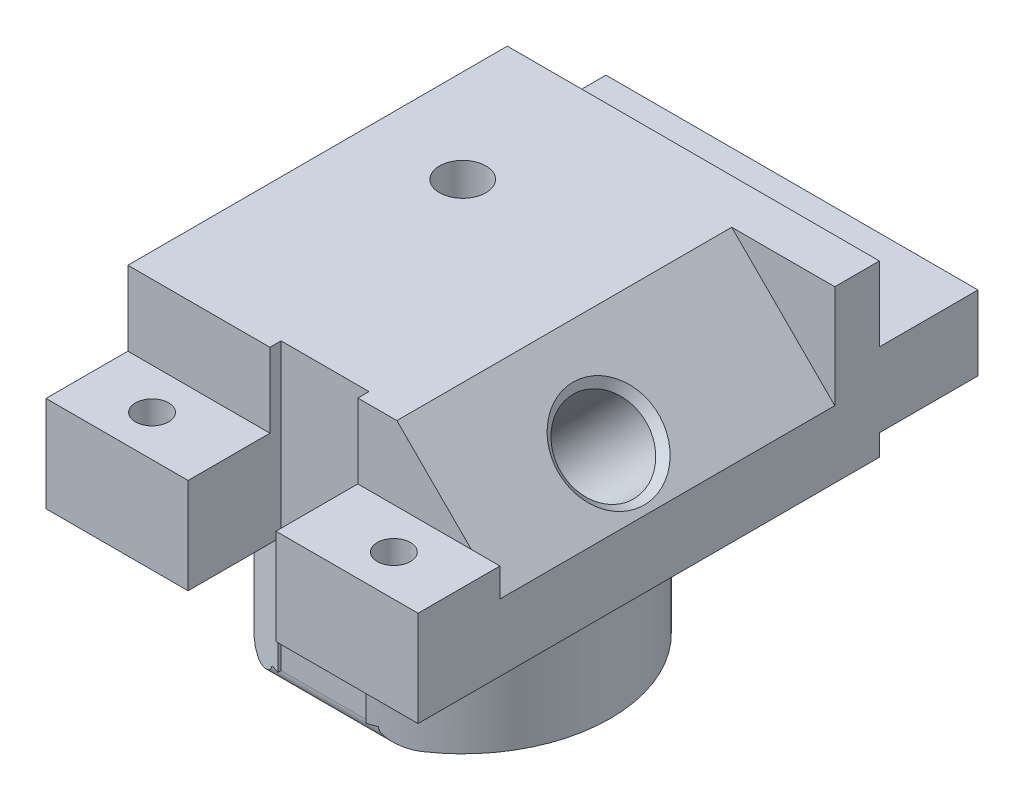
from build123d import *

# Parameters (mm, degrees)
SKETCH1_W                           = 36.83
SKETCH1_H                           = 34.163
BOSS_EXTRUDE1_DEPTH                 = 12.7
SKETCH2_R                           = 10.075653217
BOSS_EXTRUDE2_DEPTH                 = 8.89
SKETCH9_R                           = 1.640477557
BOSS_EXTRUDE3_DEPTH                 = 4.7244
BOSS_EXTRUDE3_TAPER                 = 4
SKETCH5_W                           = 36.83
SKETCH5_H                           = 2.667
CUT_EXTRUDE1_DEPTH                  = 6.175
SKETCH6_W                           = 36.83
SKETCH6_H                           = 5.588
CUT_EXTRUDE2_DEPTH                  = 6.175
F_4_40_TAPPED_HOLE2_D               = 2.2606
CHAMFER2_SIZE                       = 5.08
CUT_EXTRUDE3_DEPTH                  = 22.86
SKETCH14_R                          = 2.921
CUT_EXTRUDE5_DEPTH                  = 8.89
CHAMFER1_SIZE                       = 0.508
F_5_64_0_07813_DIAMETER_HOLE2_D     = 1.984502
F_5_64_0_07813_DIAMETER_HOLE2_DEPTH = 5.08
F_5_64_0_07813_DIAMETER_HOLE2_TIP   = 0.59620455
F_5_64_0_07813_DIAMETER_HOLE1_D     = 1.984502
F_5_64_0_07813_DIAMETER_HOLE1_DEPTH = 11.557
F_5_64_0_07813_DIAMETER_HOLE1_TIP   = 0.59620455
SKETCH21_W                          = 36.83
SKETCH21_H                          = 5.08
BOSS_EXTRUDE4_DEPTH                 = 4.064
F_4_CLEARANCE_HOLE1_D               = 2.9464
CUT_EXTRUDE6_REACH                  = 56.801
SKETCH25_W                          = 25.908
SKETCH25_H                          = 1.095
CUT_EXTRUDE7_REACH                  = 56.801
SKETCH26_W                          = 5.715
SKETCH26_H                          = 11.605
SKETCH27_W                          = 25.4
SKETCH27_H                          = 1.445
CUT_EXTRUDE8_DEPTH                  = 2.667
FILLET1_R                           = 0.127
F_1_8_0_125_DIAMETER_HOLE1_D        = 3.175
F_1_8_0_125_DIAMETER_HOLE1_DEPTH    = 10.16
SKETCH31_W                          = 6
SKETCH31_H                          = 20.495
CUT_EXTRUDE9_DEPTH                  = 6.35
CUT_EXTRUDE10_DEPTH                 = 6.35
CUT_EXTRUDE10_DEPTH_BACK            = 6.35


with BuildPart() as part:
    # Sketch1 → Boss-Extrude1 (new body)
    with BuildSketch(Plane(origin=(0, 0, 0), x_dir=(1, 0, 0), z_dir=(0, 1, 0))):
        with Locations((18.415, 17.0815)):
            Rectangle(SKETCH1_W, SKETCH1_H)
    extrude(amount=BOSS_EXTRUDE1_DEPTH)

    # Sketch2 → Boss-Extrude2 (add)
    with BuildSketch(Plane.XZ):
        with Locations(Location((18.415, -15.748, 0), (0, 0, 270))):
            Circle(SKETCH2_R)
    extrude(amount=BOSS_EXTRUDE2_DEPTH)

    # Sketch9 → Boss-Extrude3 (add)
    with BuildSketch(Plane.XZ.offset(8.89)):
        with Locations((18.415, -15.748)):
            Circle(SKETCH9_R)
    extrude(amount=BOSS_EXTRUDE3_DEPTH, taper=BOSS_EXTRUDE3_TAPER)

    # Sketch5 → Cut-Extrude1 (cut)
    with BuildSketch(Plane(origin=(0, 12.7, 0), x_dir=(1, 0, 0), z_dir=(0, 1, 0))):
        with Locations((18.415, 32.8295)):
            Rectangle(SKETCH5_W, SKETCH5_H)
    extrude(amount=-CUT_EXTRUDE1_DEPTH, mode=Mode.SUBTRACT)

    # Sketch6 → Cut-Extrude2 (cut)
    with BuildSketch(Plane(origin=(0, 12.7, 0), x_dir=(1, 0, 0), z_dir=(0, 1, 0))):
        with Locations((18.415, 2.794)):
            Rectangle(SKETCH6_W, SKETCH6_H)
    extrude(amount=-CUT_EXTRUDE2_DEPTH, mode=Mode.SUBTRACT)

    # 4-40 Tapped Hole2 (through all)
    with Locations(Plane(origin=(0, 6.525, 0), x_dir=(1, 0, 0), z_dir=(0, 1, 0))):
        with Locations((10.16, 2.794), (26.67, 2.794)):
            Hole(F_4_40_TAPPED_HOLE2_D / 2)

    # Chamfer2
    chamfer2_edges = [part.edges().sort_by_distance(p)[0] for p in [
        (36.83, 3.2625, 0),
        (0, 3.2625, 0),
    ]]
    chamfer(chamfer2_edges, length=CHAMFER2_SIZE)

    # Sketch10 → Cut-Extrude3 (cut)
    with BuildSketch(Plane(origin=(0, 0, -28.448), x_dir=(-1, 0, 0), z_dir=(0, 0, -1))):
        Polygon((-36.83, 12.7), (-22.987, 12.7), (-36.83, -1.143), align=None)
    extrude(amount=-CUT_EXTRUDE3_DEPTH, mode=Mode.SUBTRACT)

    # Sketch14 → Cut-Extrude5 (cut)
    with BuildSketch(Plane(origin=(26.480752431, 9.206247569, -1.2015923), x_dir=(0, 0, -1), z_dir=(0.7071067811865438, 0.7071067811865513, 0))):
        with Locations(Location((14.5464077, -2.679087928, 0), (0, 0, 90))):
            Circle(SKETCH14_R)
    extrude(amount=-CUT_EXTRUDE5_DEPTH, mode=Mode.SUBTRACT)

    # Chamfer1
    chamfer1_edges = [part.edges().sort_by_distance(p)[0] for p in [
        (30.44061258, 5.24638742, -15.748),
    ]]
    chamfer(chamfer1_edges, length=CHAMFER1_SIZE)

    # 5_64 _0.07813_ Diameter Hole2
    with Locations(Plane(origin=(11.557320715, 11.557320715, 0), x_dir=(0, 0, -1), z_dir=(0.7071067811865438, 0.7071067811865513, 0))):
        with Locations((15.748, -14.894007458)):
            Hole(F_5_64_0_07813_DIAMETER_HOLE2_D / 2, depth=F_5_64_0_07813_DIAMETER_HOLE2_DEPTH)
            with Locations((0, 0, -(F_5_64_0_07813_DIAMETER_HOLE2_DEPTH + F_5_64_0_07813_DIAMETER_HOLE2_TIP / 2))):  # 118° drill point
                Cone(0, F_5_64_0_07813_DIAMETER_HOLE2_D / 2, F_5_64_0_07813_DIAMETER_HOLE2_TIP, mode=Mode.SUBTRACT)

    # 5_64 _0.07813_ Diameter Hole1
    with Locations(Plane(origin=(0, -13.6144, 0), x_dir=(-1, 0, 0), z_dir=(0, -1, 0))):
        with Locations((-18.415, 15.748)):
            Hole(F_5_64_0_07813_DIAMETER_HOLE1_D / 2, depth=F_5_64_0_07813_DIAMETER_HOLE1_DEPTH)
            with Locations((0, 0, -(F_5_64_0_07813_DIAMETER_HOLE1_DEPTH + F_5_64_0_07813_DIAMETER_HOLE1_TIP / 2))):  # 118° drill point
                Cone(0, F_5_64_0_07813_DIAMETER_HOLE1_D / 2, F_5_64_0_07813_DIAMETER_HOLE1_TIP, mode=Mode.SUBTRACT)

    # Sketch21 → Boss-Extrude4 (add)
    with BuildSketch(Plane(origin=(0, 0, -34.163), x_dir=(-1, 0, 0), z_dir=(0, 0, -1))):
        with Locations((-18.415, 3.985)):
            Rectangle(SKETCH21_W, SKETCH21_H)
    extrude(amount=BOSS_EXTRUDE4_DEPTH)

    # 4 Clearance Hole1 (through all)
    with Locations(Plane(origin=(0, 0, 0), x_dir=(-1, 0, 0), z_dir=(0, -1, 0))):
        with Locations((-25.4, 34.8615), (-11.43, 34.8615)):
            Hole(F_4_CLEARANCE_HOLE1_D / 2)

    # Sketch25 → Cut-Extrude6 (cut, up to next)
    with BuildSketch(Plane.ZY, mode=Mode.PRIVATE) as cut_extrude6_sk1:
        with Locations((-18.542, 12.1525)):
            Rectangle(SKETCH25_W, SKETCH25_H)
    cut_extrude6_tool1 = extrude(cut_extrude6_sk1.sketch, amount=-CUT_EXTRUDE6_REACH, mode=Mode.PRIVATE) & part.part
    add(cut_extrude6_tool1.solids().sort_by_distance((0, 12.1525, -18.542))[0], mode=Mode.SUBTRACT)

    # Sketch26 → Cut-Extrude7 (cut, up to next)
    with BuildSketch(Plane.XY, mode=Mode.PRIVATE) as cut_extrude7_sk1:
        with Locations((2.8575, 5.8025)):
            Rectangle(SKETCH26_W, SKETCH26_H)
    cut_extrude7_tool1 = extrude(cut_extrude7_sk1.sketch, amount=-CUT_EXTRUDE7_REACH, mode=Mode.PRIVATE) & part.part
    # Sketch26 → Cut-Extrude7 (cut, up to next)
    with BuildSketch(Plane.XY, mode=Mode.PRIVATE) as cut_extrude7_sk2:
        with Locations((33.9725, 5.8025)):
            Rectangle(SKETCH26_W, SKETCH26_H)
    cut_extrude7_tool2 = extrude(cut_extrude7_sk2.sketch, amount=-CUT_EXTRUDE7_REACH, mode=Mode.PRIVATE) & part.part
    add(cut_extrude7_tool1.solids().sort_by_distance((2.8575, 5.8025, 0))[0], mode=Mode.SUBTRACT)
    add(cut_extrude7_tool2.solids().sort_by_distance((33.9725, 5.8025, 0))[0], mode=Mode.SUBTRACT)

    # Sketch27 → Cut-Extrude8 (cut)
    with BuildSketch(Plane(origin=(0, 0, -34.163), x_dir=(-1, 0, 0), z_dir=(0, 0, -1))):
        with Locations((-18.415, 0.7225)):
            Rectangle(SKETCH27_W, SKETCH27_H)
    extrude(amount=-CUT_EXTRUDE8_DEPTH, mode=Mode.SUBTRACT)

    # Sketch28 → Cut-Revolve1 (revolve, cut)
    with BuildSketch(Plane(origin=(18.415, 0, 0), x_dir=(0, 0, -1), z_dir=(1, 0, 0)), mode=Mode.PRIVATE) as cut_revolve1_sk:
        with BuildLine():
            Line((19.0246, -8.89), (20.3454, -8.89))
            Line((20.3454, -8.89), (20.667612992, -8.166297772))
            ThreePointArc((20.667612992, -8.166297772), (20.637183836, -7.779658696), (20.296348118, -7.5946))
            Line((20.296348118, -7.5946), (19.073651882, -7.5946))
            ThreePointArc((19.073651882, -7.5946), (18.732816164, -7.779658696), (18.702387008, -8.166297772))
            Line((18.702387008, -8.166297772), (19.0246, -8.89))
        make_face()
    revolve(cut_revolve1_sk.sketch.rotate(Axis((18.415, -8.166297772, -15.748), (0, 1, 0)), 180), axis=Axis((18.415, -8.166297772, -15.748), (0, 1, 0)), mode=Mode.SUBTRACT)

    # Fillet1
    fillet1_edges = [part.edges().sort_by_distance(p)[0] for p in [
        (18.415, -8.89, -19.0246),
        (18.415, -8.89, -20.3454),
    ]]
    fillet(fillet1_edges, radius=FILLET1_R)

    # 1_8 _0.125_ Diameter Hole1
    with Locations(Plane(origin=(0, 11.605, 0), x_dir=(1, 0, 0), z_dir=(0, 1, 0))):
        with Locations((12.065, 22.098)):
            Hole(F_1_8_0_125_DIAMETER_HOLE1_D / 2, depth=F_1_8_0_125_DIAMETER_HOLE1_DEPTH)

    # Sketch31 → Cut-Extrude9 (cut)
    with BuildSketch(Plane.XY):
        with Locations((18.415, 1.3575)):
            Rectangle(SKETCH31_W, SKETCH31_H)
    extrude(amount=-CUT_EXTRUDE9_DEPTH, mode=Mode.SUBTRACT)

    # Sketch32 → Cut-Extrude10 (cut, two sides: drawn at the far end of the back side and taken through both)
    with BuildSketch(Plane(origin=(18.415, 0, 0), x_dir=(0, 0, -1), z_dir=(1, 0, 0)).offset(-CUT_EXTRUDE10_DEPTH_BACK)):
        with BuildLine():
            Line((7.35, -8.89), (6.12933129, -8.89))
            Line((6.12933129, -8.89), (6.12933129, -7.89))
            Line((6.12933129, -7.89), (6.35, -7.89))
            ThreePointArc((6.35, -7.89), (6.642893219, -8.597106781), (7.35, -8.89))
        make_face()
    extrude(amount=CUT_EXTRUDE10_DEPTH + CUT_EXTRUDE10_DEPTH_BACK, mode=Mode.SUBTRACT)


solid = part.part
